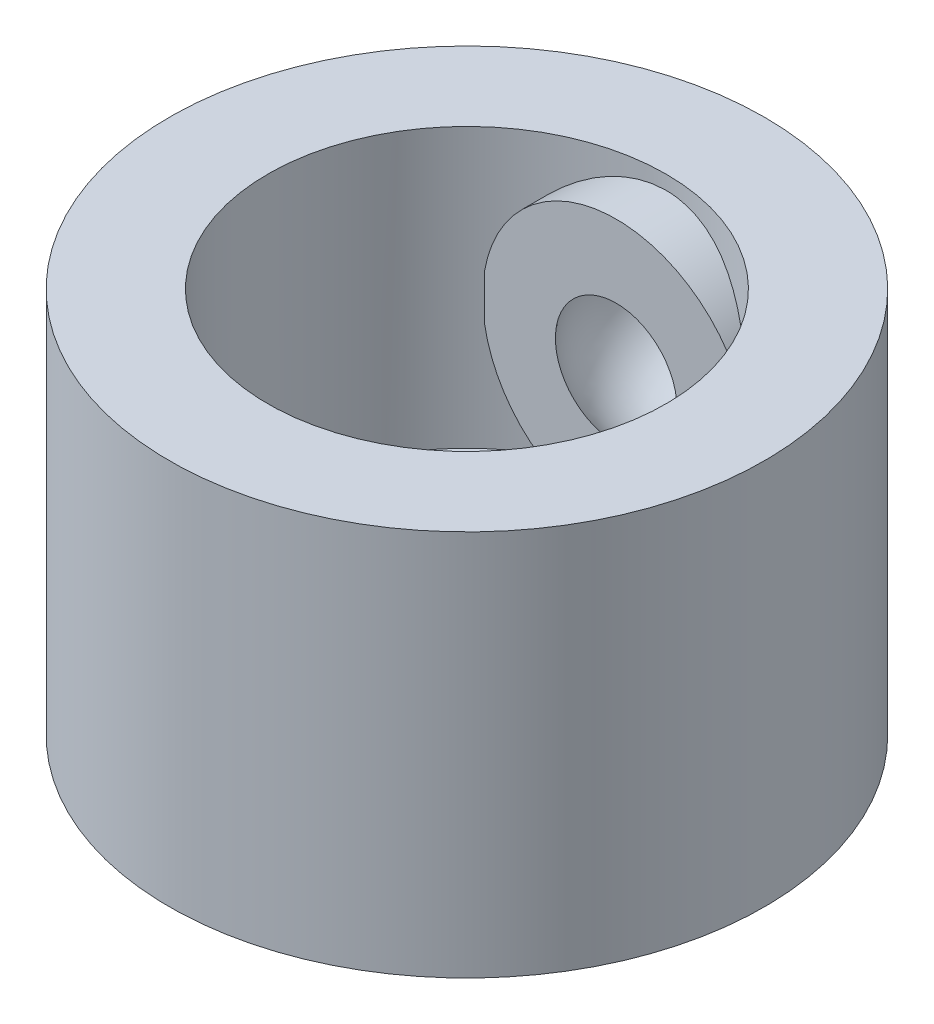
from build123d import *

# Parameters (mm, degrees)
SKETCH2_R                 = 5.75
CUT_EXTRUDE1_DEPTH        = 28.714436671
F_6_32_TAPPED_HOLE1_D     = 2.7051
F_6_32_TAPPED_HOLE1_DEPTH = 14
F_6_32_TAPPED_HOLE1_TIP   = 0.81269403
CUT_EXTRUDE3_DEPTH        = 10


with BuildPart() as part:
    # Sketch1 → Revolve1 (revolve)
    with BuildSketch(Plane.XY, mode=Mode.PRIVATE) as revolve1_sk:
        Polygon((-2.5, 0), (-8.06, 0), (-8.06, 0.66), (-14.2, 0.66), (-14.2, 19.1), (-9.5, 19.1), (-9.5, 5.8), (-2.5, 5.8), align=None)
    revolve(revolve1_sk.sketch.rotate(Axis((0, 0, 0), (0, 1, 0)), 270), axis=Axis((0, 0, 0), (0, 1, 0)))

    # Sketch2 → Cut-Extrude1 (cut, through all)
    with BuildSketch(Plane.XY):
        with Locations(Location((0, 12.05, 0), (0, 0, 90))):
            Circle(SKETCH2_R)
    extrude(amount=-CUT_EXTRUDE1_DEPTH, mode=Mode.SUBTRACT)

    # Sketch4 → Revolve2 (revolve)
    with BuildSketch(Plane(origin=(0, 12.05, 0), x_dir=(1, 0, 0), z_dir=(0, 1, 0))):
        with BuildLine():
            Line((2.901801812, 7.123756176), (6.376793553, 7.123756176))
            Line((6.376793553, 7.123756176), (6.376793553, 12.410474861))
            Line((6.376793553, 12.410474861), (3.016384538, 12.410474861))
            ThreePointArc((3.016384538, 12.410474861), (3.96781817, 9.745252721), (2.901801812, 7.123756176))
        make_face()
    revolve(axis=Axis((0, 12.05, -13.8), (0, 0, 1)))

    # 6-32 Tapped Hole1
    with Locations(Plane(origin=(0, 3.66, -14.2), x_dir=(-1, 0, 0), z_dir=(0, 0, -1))):
        with Locations((0, 0)):
            Hole(F_6_32_TAPPED_HOLE1_D / 2, depth=F_6_32_TAPPED_HOLE1_DEPTH)
            with Locations((0, 0, -(F_6_32_TAPPED_HOLE1_DEPTH + F_6_32_TAPPED_HOLE1_TIP / 2))):  # 118° drill point
                Cone(0, F_6_32_TAPPED_HOLE1_D / 2, F_6_32_TAPPED_HOLE1_TIP, mode=Mode.SUBTRACT)

    # Sketch6 → Cut-Extrude3 (cut)
    with BuildSketch(Plane.XZ):
        Polygon((-3.666174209, 0), (-1.833087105, -3.175), (1.833087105, -3.175), (3.666174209, 0), (1.833087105, 3.175), (-1.833087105, 3.175), align=None)
    extrude(amount=-CUT_EXTRUDE3_DEPTH, mode=Mode.SUBTRACT)


solid = part.part
